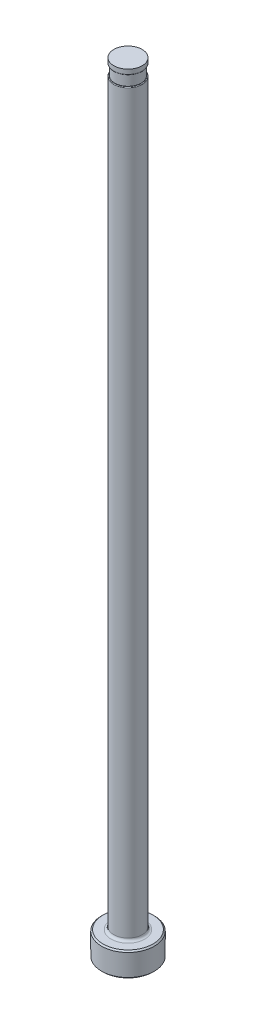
ISO-10303-21;
HEADER;
FILE_DESCRIPTION(('STEP AP214'),'2;1');
FILE_NAME('part.step','',(''),(''),'','','');
FILE_SCHEMA(('AUTOMOTIVE_DESIGN { 1 0 10303 214 1 1 1 1 }'));
ENDSEC;
DATA;
#1=APPLICATION_CONTEXT('core data for automotive mechanical design processes');
#2=APPLICATION_PROTOCOL_DEFINITION('international standard','automotive_design',2000,#1);
#3=PRODUCT_CONTEXT('',#1,'mechanical');
#4=PRODUCT('Part','Part','',(#3));
#5=PRODUCT_RELATED_PRODUCT_CATEGORY('part','',(#4));
#6=PRODUCT_DEFINITION_FORMATION('','',#4);
#7=PRODUCT_DEFINITION_CONTEXT('part definition',#1,'design');
#8=PRODUCT_DEFINITION('design','',#6,#7);
#9=PRODUCT_DEFINITION_SHAPE('','',#8);
#10=(LENGTH_UNIT() NAMED_UNIT(*) SI_UNIT(.MILLI.,.METRE.));
#11=(NAMED_UNIT(*) PLANE_ANGLE_UNIT() SI_UNIT($,.RADIAN.));
#12=(NAMED_UNIT(*) SI_UNIT($,.STERADIAN.) SOLID_ANGLE_UNIT());
#13=UNCERTAINTY_MEASURE_WITH_UNIT(LENGTH_MEASURE(1.E-05),#10,'distance_accuracy_value','');
#14=(GEOMETRIC_REPRESENTATION_CONTEXT(3) GLOBAL_UNCERTAINTY_ASSIGNED_CONTEXT((#13)) GLOBAL_UNIT_ASSIGNED_CONTEXT((#10,
#11,#12)) REPRESENTATION_CONTEXT('',''));
#15=CARTESIAN_POINT('',(0.,0.,0.));
#16=DIRECTION('',(0.,0.,1.));
#17=DIRECTION('',(1.,0.,0.));
#18=AXIS2_PLACEMENT_3D('',#15,#16,#17);
#19=CARTESIAN_POINT('',(-2.77748999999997,151.384,0.));
#20=DIRECTION('',(0.,1.,0.));
#21=DIRECTION('',(0.,0.,1.));
#22=AXIS2_PLACEMENT_3D('',#19,#20,#21);
#23=PLANE('',#22);
#24=CARTESIAN_POINT('',(0.,151.384,0.));
#25=DIRECTION('',(0.,1.,0.));
#26=DIRECTION('',(0.,0.,1.));
#27=AXIS2_PLACEMENT_3D('',#24,#25,#26);
#28=CIRCLE('',#27,2.64540999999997);
#29=CARTESIAN_POINT('',(0.,151.384,2.64540999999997));
#30=VERTEX_POINT('',#29);
#31=EDGE_CURVE('E11',#30,#30,#28,.F.);
#32=ORIENTED_EDGE('',*,*,#31,.T.);
#33=EDGE_LOOP('',(#32));
#34=FACE_BOUND('',#33,.T.);
#35=CARTESIAN_POINT('',(0.,151.384,0.));
#36=DIRECTION('',(0.,1.,0.));
#37=DIRECTION('',(0.,0.,1.));
#38=AXIS2_PLACEMENT_3D('',#35,#36,#37);
#39=CIRCLE('',#38,2.57428999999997);
#40=CARTESIAN_POINT('',(0.,151.384,2.57428999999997));
#41=VERTEX_POINT('',#40);
#42=EDGE_CURVE('E78',#41,#41,#39,.T.);
#43=ORIENTED_EDGE('',*,*,#42,.T.);
#44=EDGE_LOOP('',(#43));
#45=FACE_BOUND('',#44,.T.);
#46=ADVANCED_FACE('F36',(#34,#45),#23,.F.);
#47=CARTESIAN_POINT('',(0.,259.958771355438,0.));
#48=DIRECTION('',(0.,1.,0.));
#49=DIRECTION('',(0.,0.,1.));
#50=AXIS2_PLACEMENT_3D('',#47,#48,#49);
#51=CYLINDRICAL_SURFACE('',#50,2.77748999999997);
#52=DIRECTION('',(0.,1.,0.));
#53=VECTOR('',#52,1.);
#54=CARTESIAN_POINT('',(-2.57428999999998,259.958771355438,-1.04282390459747));
#55=LINE('',#54,#53);
#56=CARTESIAN_POINT('',(-2.57428999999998,149.225,-1.04282390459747));
#57=VERTEX_POINT('',#56);
#58=CARTESIAN_POINT('',(-2.57428999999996,86.868,-1.04282390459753));
#59=VERTEX_POINT('',#58);
#60=EDGE_CURVE('E73',#57,#59,#55,.F.);
#61=ORIENTED_EDGE('',*,*,#60,.F.);
#62=CARTESIAN_POINT('',(0.,149.225,0.));
#63=DIRECTION('',(0.,-1.,0.));
#64=DIRECTION('',(0.,0.,-1.));
#65=AXIS2_PLACEMENT_3D('',#62,#63,#64);
#66=CIRCLE('',#65,2.77748999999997);
#67=CARTESIAN_POINT('',(-2.57428999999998,149.225,1.04282390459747));
#68=VERTEX_POINT('',#67);
#69=EDGE_CURVE('E51',#57,#68,#66,.T.);
#70=ORIENTED_EDGE('',*,*,#69,.T.);
#71=DIRECTION('',(0.,1.,0.));
#72=VECTOR('',#71,1.);
#73=CARTESIAN_POINT('',(-2.57428999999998,259.958771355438,1.04282390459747));
#74=LINE('',#73,#72);
#75=CARTESIAN_POINT('',(-2.57428999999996,86.868,1.04282390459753));
#76=VERTEX_POINT('',#75);
#77=EDGE_CURVE('E84',#76,#68,#74,.T.);
#78=ORIENTED_EDGE('',*,*,#77,.F.);
#79=CARTESIAN_POINT('',(-2.57428999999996,86.868,-1.04282390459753));
#80=CARTESIAN_POINT('',(-2.57428787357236,86.8355852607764,-1.04282111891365));
#81=CARTESIAN_POINT('',(-2.57478701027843,86.8031850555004,-1.04159798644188));
#82=CARTESIAN_POINT('',(-2.57676382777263,86.7385964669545,-1.03670102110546));
#83=CARTESIAN_POINT('',(-2.57824163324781,86.7064081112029,-1.03302687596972));
#84=CARTESIAN_POINT('',(-2.58411032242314,86.610391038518,-1.01830472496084));
#85=CARTESIAN_POINT('',(-2.58993639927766,86.5471681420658,-1.00355696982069));
#86=CARTESIAN_POINT('',(-2.60484835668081,86.4241975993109,-0.964186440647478));
#87=CARTESIAN_POINT('',(-2.61393879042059,86.3644549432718,-0.939549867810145));
#88=CARTESIAN_POINT('',(-2.63439257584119,86.2504330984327,-0.880565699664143));
#89=CARTESIAN_POINT('',(-2.64575368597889,86.1961486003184,-0.846227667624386));
#90=CARTESIAN_POINT('',(-2.66906948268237,86.0963648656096,-0.769463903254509));
#91=CARTESIAN_POINT('',(-2.68099701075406,86.050654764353,-0.727304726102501));
#92=CARTESIAN_POINT('',(-2.70429977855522,85.9677106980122,-0.635186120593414));
#93=CARTESIAN_POINT('',(-2.71567511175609,85.930475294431,-0.585228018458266));
#94=CARTESIAN_POINT('',(-2.73569711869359,85.8680565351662,-0.482647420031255));
#95=CARTESIAN_POINT('',(-2.74447837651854,85.8422160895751,-0.430450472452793));
#96=CARTESIAN_POINT('',(-2.75929586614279,85.7997915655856,-0.322059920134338));
#97=CARTESIAN_POINT('',(-2.76533294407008,85.7832046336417,-0.265867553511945));
#98=CARTESIAN_POINT('',(-2.77376309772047,85.7602965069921,-0.153923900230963));
#99=CARTESIAN_POINT('',(-2.77631330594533,85.7535317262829,-0.0982747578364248));
#100=CARTESIAN_POINT('',(-2.77801884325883,85.7489917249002,0.0134385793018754));
#101=CARTESIAN_POINT('',(-2.7771745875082,85.751215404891,0.0695027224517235));
#102=CARTESIAN_POINT('',(-2.7722209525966,85.7644908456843,0.179520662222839));
#103=CARTESIAN_POINT('',(-2.76816343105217,85.7754024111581,0.233493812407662));
#104=CARTESIAN_POINT('',(-2.75726458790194,85.8056137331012,0.338736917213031));
#105=CARTESIAN_POINT('',(-2.7504233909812,85.8249131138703,0.390006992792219));
#106=CARTESIAN_POINT('',(-2.73459621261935,85.871579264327,0.488834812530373));
#107=CARTESIAN_POINT('',(-2.7255949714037,85.8990037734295,0.536362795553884));
#108=CARTESIAN_POINT('',(-2.70638807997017,85.9611227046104,0.626118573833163));
#109=CARTESIAN_POINT('',(-2.69618232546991,85.995817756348,0.668345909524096));
#110=CARTESIAN_POINT('',(-2.67522940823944,86.0727559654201,0.747895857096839));
#111=CARTESIAN_POINT('',(-2.66447542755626,86.1152077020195,0.785014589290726));
#112=CARTESIAN_POINT('',(-2.64380227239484,86.2056395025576,0.852053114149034));
#113=CARTESIAN_POINT('',(-2.63388340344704,86.2536215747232,0.881970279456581));
#114=CARTESIAN_POINT('',(-2.61524736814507,86.3568148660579,0.935839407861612));
#115=CARTESIAN_POINT('',(-2.60663744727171,86.4122867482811,0.959328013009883));
#116=CARTESIAN_POINT('',(-2.5921893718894,86.5264618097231,0.997711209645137));
#117=CARTESIAN_POINT('',(-2.58635078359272,86.5851644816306,1.01260714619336));
#118=CARTESIAN_POINT('',(-2.57955503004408,86.6815266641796,1.02975451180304));
#119=CARTESIAN_POINT('',(-2.57758531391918,86.7186676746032,1.03466198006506));
#120=CARTESIAN_POINT('',(-2.57495138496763,86.7932020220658,1.04119168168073));
#121=CARTESIAN_POINT('',(-2.57428434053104,86.8305946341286,1.04282104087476));
#122=CARTESIAN_POINT('',(-2.57428999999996,86.868,1.04282390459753));
#123=B_SPLINE_CURVE_WITH_KNOTS('',3,(#79,#80,#81,#82,#83,#84,#85,#86,#87,#88,#89,#90,#91,#92,
#93,#94,#95,#96,#97,#98,#99,#100,#101,#102,#103,#104,#105,#106,#107,#108,#109,#110,#111,#112,
#113,#114,#115,#116,#117,#118,#119,#120,#121,#122),.UNSPECIFIED.,.F.,.F.,(4,2,2,2,2,2,2,2,2,2,2,
2,2,2,2,2,2,2,2,2,2,4),(0.,0.0971880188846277,0.194388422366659,0.388960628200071,
0.583805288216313,0.778458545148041,0.967406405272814,1.15632216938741,1.33212671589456,
1.50787701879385,1.67541271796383,1.84292792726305,2.00779344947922,2.17265158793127,
2.33871056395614,2.5047839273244,2.67625192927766,2.84778239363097,3.02956415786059,
3.21131745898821,3.32371085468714,3.43585966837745),.UNSPECIFIED.);
#124=EDGE_CURVE('E81',#59,#76,#123,.T.);
#125=ORIENTED_EDGE('',*,*,#124,.F.);
#126=EDGE_LOOP('',(#61,#70,#78,#125));
#127=FACE_BOUND('',#126,.T.);
#128=CARTESIAN_POINT('',(0.,5.25779999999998,0.));
#129=DIRECTION('',(0.,1.,0.));
#130=DIRECTION('',(0.,0.,1.));
#131=AXIS2_PLACEMENT_3D('',#128,#129,#130);
#132=CIRCLE('',#131,2.77748999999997);
#133=CARTESIAN_POINT('',(0.,5.25779999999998,2.77748999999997));
#134=VERTEX_POINT('',#133);
#135=EDGE_CURVE('E116',#134,#134,#132,.T.);
#136=ORIENTED_EDGE('',*,*,#135,.T.);
#137=EDGE_LOOP('',(#136));
#138=FACE_BOUND('',#137,.T.);
#139=ADVANCED_FACE('F82',(#127,#138),#51,.T.);
#140=CARTESIAN_POINT('',(0.,0.,0.));
#141=DIRECTION('',(0.,-1.,0.));
#142=DIRECTION('',(0.,0.,-1.));
#143=AXIS2_PLACEMENT_3D('',#140,#141,#142);
#144=PLANE('',#143);
#145=CARTESIAN_POINT('',(0.,0.,0.));
#146=DIRECTION('',(0.,-1.,0.));
#147=DIRECTION('',(0.,0.,-1.));
#148=AXIS2_PLACEMENT_3D('',#145,#146,#147);
#149=CIRCLE('',#148,4.90220000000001);
#150=CARTESIAN_POINT('',(0.,0.,-4.90220000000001));
#151=VERTEX_POINT('',#150);
#152=EDGE_CURVE('E113',#151,#151,#149,.T.);
#153=ORIENTED_EDGE('',*,*,#152,.T.);
#154=EDGE_LOOP('',(#153));
#155=FACE_BOUND('',#154,.T.);
#156=ADVANCED_FACE('F192',(#155),#144,.T.);
#157=CARTESIAN_POINT('',(0.,259.958771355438,0.));
#158=DIRECTION('',(0.,1.,0.));
#159=DIRECTION('',(0.,0.,1.));
#160=AXIS2_PLACEMENT_3D('',#157,#158,#159);
#161=CYLINDRICAL_SURFACE('',#160,5.15619999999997);
#162=CARTESIAN_POINT('',(0.,4.49580000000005,0.));
#163=DIRECTION('',(0.,1.,0.));
#164=DIRECTION('',(0.,0.,1.));
#165=AXIS2_PLACEMENT_3D('',#162,#163,#164);
#166=CIRCLE('',#165,5.15619999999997);
#167=CARTESIAN_POINT('',(0.,4.49580000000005,5.15619999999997));
#168=VERTEX_POINT('',#167);
#169=EDGE_CURVE('E110',#168,#168,#166,.F.);
#170=ORIENTED_EDGE('',*,*,#169,.T.);
#171=EDGE_LOOP('',(#170));
#172=FACE_BOUND('',#171,.T.);
#173=CARTESIAN_POINT('',(0.,0.253999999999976,0.));
#174=DIRECTION('',(0.,-1.,0.));
#175=DIRECTION('',(0.,0.,-1.));
#176=AXIS2_PLACEMENT_3D('',#173,#174,#175);
#177=CIRCLE('',#176,5.15619999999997);
#178=CARTESIAN_POINT('',(0.,0.253999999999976,-5.15619999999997));
#179=VERTEX_POINT('',#178);
#180=EDGE_CURVE('E107',#179,#179,#177,.F.);
#181=ORIENTED_EDGE('',*,*,#180,.T.);
#182=EDGE_LOOP('',(#181));
#183=FACE_BOUND('',#182,.T.);
#184=ADVANCED_FACE('F195',(#172,#183),#161,.T.);
#185=CARTESIAN_POINT('',(-5.15619999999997,4.7498,0.));
#186=DIRECTION('',(0.,1.,0.));
#187=DIRECTION('',(0.,0.,1.));
#188=AXIS2_PLACEMENT_3D('',#185,#186,#187);
#189=PLANE('',#188);
#190=CARTESIAN_POINT('',(0.,4.7498,0.));
#191=DIRECTION('',(0.,1.,0.));
#192=DIRECTION('',(0.,0.,1.));
#193=AXIS2_PLACEMENT_3D('',#190,#191,#192);
#194=CIRCLE('',#193,3.28548999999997);
#195=CARTESIAN_POINT('',(0.,4.7498,3.28548999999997));
#196=VERTEX_POINT('',#195);
#197=EDGE_CURVE('E87',#196,#196,#194,.F.);
#198=ORIENTED_EDGE('',*,*,#197,.T.);
#199=EDGE_LOOP('',(#198));
#200=FACE_BOUND('',#199,.T.);
#201=CARTESIAN_POINT('',(0.,4.7498,0.));
#202=DIRECTION('',(0.,1.,0.));
#203=DIRECTION('',(0.,0.,1.));
#204=AXIS2_PLACEMENT_3D('',#201,#202,#203);
#205=CIRCLE('',#204,4.90220000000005);
#206=CARTESIAN_POINT('',(0.,4.7498,4.90220000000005));
#207=VERTEX_POINT('',#206);
#208=EDGE_CURVE('E104',#207,#207,#205,.T.);
#209=ORIENTED_EDGE('',*,*,#208,.T.);
#210=EDGE_LOOP('',(#209));
#211=FACE_BOUND('',#210,.T.);
#212=ADVANCED_FACE('F190',(#200,#211),#189,.T.);
#213=CARTESIAN_POINT('',(0.,4.74980000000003,0.));
#214=DIRECTION('',(0.,-1.,0.));
#215=DIRECTION('',(0.,0.,-1.));
#216=AXIS2_PLACEMENT_3D('',#213,#214,#215);
#217=CONICAL_SURFACE('',#216,4.90220000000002,0.785398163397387);
#218=ORIENTED_EDGE('',*,*,#169,.F.);
#219=EDGE_LOOP('',(#218));
#220=FACE_BOUND('',#219,.T.);
#221=ORIENTED_EDGE('',*,*,#208,.F.);
#222=EDGE_LOOP('',(#221));
#223=FACE_BOUND('',#222,.T.);
#224=ADVANCED_FACE('F186',(#220,#223),#217,.T.);
#225=CARTESIAN_POINT('',(0.,0.253999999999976,0.));
#226=DIRECTION('',(0.,1.,0.));
#227=DIRECTION('',(0.,0.,1.));
#228=AXIS2_PLACEMENT_3D('',#225,#226,#227);
#229=CONICAL_SURFACE('',#228,5.15619999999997,0.785398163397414);
#230=ORIENTED_EDGE('',*,*,#152,.F.);
#231=EDGE_LOOP('',(#230));
#232=FACE_BOUND('',#231,.T.);
#233=ORIENTED_EDGE('',*,*,#180,.F.);
#234=EDGE_LOOP('',(#233));
#235=FACE_BOUND('',#234,.T.);
#236=ADVANCED_FACE('F182',(#232,#235),#229,.T.);
#237=CARTESIAN_POINT('',(0.,5.25779999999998,0.));
#238=DIRECTION('',(0.,1.,0.));
#239=DIRECTION('',(0.,0.,1.));
#240=AXIS2_PLACEMENT_3D('',#237,#238,#239);
#241=TOROIDAL_SURFACE('',#240,3.28548999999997,0.508);
#242=ORIENTED_EDGE('',*,*,#197,.F.);
#243=EDGE_LOOP('',(#242));
#244=FACE_BOUND('',#243,.T.);
#245=ORIENTED_EDGE('',*,*,#135,.F.);
#246=EDGE_LOOP('',(#245));
#247=FACE_BOUND('',#246,.T.);
#248=ADVANCED_FACE('F147',(#244,#247),#241,.F.);
#249=CARTESIAN_POINT('',(-2.77748999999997,149.352,0.));
#250=DIRECTION('',(0.,-1.,0.));
#251=DIRECTION('',(0.,0.,-1.));
#252=AXIS2_PLACEMENT_3D('',#249,#250,#251);
#253=PLANE('',#252);
#254=DIRECTION('',(0.,0.,1.));
#255=VECTOR('',#254,1.);
#256=CARTESIAN_POINT('',(-2.57428999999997,149.352,0.));
#257=LINE('',#256,#255);
#258=CARTESIAN_POINT('',(-2.57428999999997,149.352,0.));
#259=VERTEX_POINT('',#258);
#260=CARTESIAN_POINT('',(-2.57428999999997,149.352,0.630974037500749));
#261=VERTEX_POINT('',#260);
#262=EDGE_CURVE('E90',#259,#261,#257,.T.);
#263=ORIENTED_EDGE('',*,*,#262,.T.);
#264=CARTESIAN_POINT('',(0.,149.352,0.));
#265=DIRECTION('',(0.,-1.,0.));
#266=DIRECTION('',(0.,0.,-1.));
#267=AXIS2_PLACEMENT_3D('',#264,#265,#266);
#268=CIRCLE('',#267,2.65048999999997);
#269=CARTESIAN_POINT('',(-2.57428999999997,149.352,-0.630974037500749));
#270=VERTEX_POINT('',#269);
#271=EDGE_CURVE('E86',#261,#270,#268,.F.);
#272=ORIENTED_EDGE('',*,*,#271,.T.);
#273=EDGE_CURVE('E79',#270,#259,#257,.T.);
#274=ORIENTED_EDGE('',*,*,#273,.T.);
#275=CARTESIAN_POINT('',(0.,149.352,0.));
#276=DIRECTION('',(0.,1.,0.));
#277=DIRECTION('',(0.,0.,1.));
#278=AXIS2_PLACEMENT_3D('',#275,#276,#277);
#279=CIRCLE('',#278,2.57428999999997);
#280=EDGE_CURVE('E101',#259,#259,#279,.T.);
#281=ORIENTED_EDGE('',*,*,#280,.F.);
#282=EDGE_LOOP('',(#263,#272,#274,#281));
#283=FACE_BOUND('',#282,.T.);
#284=ADVANCED_FACE('F144',(#283),#253,.F.);
#285=CARTESIAN_POINT('',(0.,153.448281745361,0.));
#286=DIRECTION('',(0.,1.,0.));
#287=DIRECTION('',(0.,0.,1.));
#288=AXIS2_PLACEMENT_3D('',#285,#286,#287);
#289=CYLINDRICAL_SURFACE('',#288,2.57428999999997);
#290=ORIENTED_EDGE('',*,*,#42,.F.);
#291=EDGE_LOOP('',(#290));
#292=FACE_BOUND('',#291,.T.);
#293=ORIENTED_EDGE('',*,*,#280,.T.);
#294=EDGE_LOOP('',(#293));
#295=FACE_BOUND('',#294,.T.);
#296=ADVANCED_FACE('F141',(#292,#295),#289,.T.);
#297=CARTESIAN_POINT('',(-2.57428999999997,150.368,-5.15619999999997));
#298=DIRECTION('',(1.,0.,0.));
#299=DIRECTION('',(0.,1.,0.));
#300=AXIS2_PLACEMENT_3D('',#297,#298,#299);
#301=PLANE('',#300);
#302=ORIENTED_EDGE('',*,*,#273,.F.);
#303=CARTESIAN_POINT('',(-2.57428999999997,149.352,-0.630974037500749));
#304=CARTESIAN_POINT('',(-2.57428999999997,149.351988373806,-0.652186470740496));
#305=CARTESIAN_POINT('',(-2.57428999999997,149.351697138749,-0.67340907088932));
#306=CARTESIAN_POINT('',(-2.57428999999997,149.350309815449,-0.715909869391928));
#307=CARTESIAN_POINT('',(-2.57428999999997,149.349210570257,-0.737187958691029));
#308=CARTESIAN_POINT('',(-2.57428999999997,149.345955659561,-0.779696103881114));
#309=CARTESIAN_POINT('',(-2.57428999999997,149.343798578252,-0.800926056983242));
#310=CARTESIAN_POINT('',(-2.57428999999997,149.338053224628,-0.843171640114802));
#311=CARTESIAN_POINT('',(-2.57428999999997,149.334467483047,-0.864187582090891));
#312=CARTESIAN_POINT('',(-2.57428999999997,149.32767465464,-0.894737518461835));
#313=CARTESIAN_POINT('',(-2.57428999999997,149.325275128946,-0.904450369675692));
#314=CARTESIAN_POINT('',(-2.57428999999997,149.319899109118,-0.923745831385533));
#315=CARTESIAN_POINT('',(-2.57428999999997,149.316921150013,-0.93332804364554));
#316=CARTESIAN_POINT('',(-2.57428999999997,149.309733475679,-0.95367532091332));
#317=CARTESIAN_POINT('',(-2.57428999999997,149.305405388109,-0.964399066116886));
#318=CARTESIAN_POINT('',(-2.57428999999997,149.295429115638,-0.985202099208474));
#319=CARTESIAN_POINT('',(-2.57428999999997,149.289787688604,-0.995284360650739));
#320=CARTESIAN_POINT('',(-2.57428999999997,149.280621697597,-1.00826014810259));
#321=CARTESIAN_POINT('',(-2.57428999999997,149.277943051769,-1.01174615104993));
#322=CARTESIAN_POINT('',(-2.57428999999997,149.272228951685,-1.01843326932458));
#323=CARTESIAN_POINT('',(-2.57428999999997,149.269192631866,-1.02163365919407));
#324=CARTESIAN_POINT('',(-2.57428999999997,149.262665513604,-1.02764631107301));
#325=CARTESIAN_POINT('',(-2.57428999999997,149.259168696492,-1.03045218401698));
#326=CARTESIAN_POINT('',(-2.57428999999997,149.251739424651,-1.03537629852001));
#327=CARTESIAN_POINT('',(-2.57428999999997,149.247810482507,-1.03749960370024));
#328=CARTESIAN_POINT('',(-2.57428999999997,149.240740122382,-1.04030637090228));
#329=CARTESIAN_POINT('',(-2.57428999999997,149.23769508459,-1.04122798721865));
#330=CARTESIAN_POINT('',(-2.57428999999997,149.231439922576,-1.04249667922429));
#331=CARTESIAN_POINT('',(-2.57428999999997,149.228227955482,-1.04283449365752));
#332=CARTESIAN_POINT('',(-2.57428999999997,149.225,-1.04282390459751));
#333=B_SPLINE_CURVE_WITH_KNOTS('',3,(#303,#304,#305,#306,#307,#308,#309,#310,#311,#312,#313,
#314,#315,#316,#317,#318,#319,#320,#321,#322,#323,#324,#325,#326,#327,#328,#329,#330,#331,#332),
.UNSPECIFIED.,.F.,.F.,(4,2,2,2,2,2,2,2,2,2,2,2,2,2,4),(0.,0.0636515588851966,0.127553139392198,
0.191540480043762,0.255414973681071,0.285417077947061,0.315496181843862,0.350142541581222,
0.384614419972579,0.397785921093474,0.410989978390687,0.424387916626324,0.437684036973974,
0.447175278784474,0.45681575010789),.UNSPECIFIED.);
#334=EDGE_CURVE('E59',#270,#57,#333,.T.);
#335=ORIENTED_EDGE('',*,*,#334,.T.);
#336=ORIENTED_EDGE('',*,*,#60,.T.);
#337=DIRECTION('',(0.,0.,1.));
#338=VECTOR('',#337,1.);
#339=CARTESIAN_POINT('',(-2.57428999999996,86.868,-5.15619999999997));
#340=LINE('',#339,#338);
#341=EDGE_CURVE('E77',#59,#76,#340,.T.);
#342=ORIENTED_EDGE('',*,*,#341,.T.);
#343=ORIENTED_EDGE('',*,*,#77,.T.);
#344=CARTESIAN_POINT('',(-2.57428999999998,149.225,1.04282390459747));
#345=CARTESIAN_POINT('',(-2.57428999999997,149.227997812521,1.04283236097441));
#346=CARTESIAN_POINT('',(-2.57428999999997,149.230984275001,1.04254163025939));
#347=CARTESIAN_POINT('',(-2.57428999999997,149.23682304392,1.04144104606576));
#348=CARTESIAN_POINT('',(-2.57428999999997,149.239676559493,1.04063771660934));
#349=CARTESIAN_POINT('',(-2.57428999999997,149.245880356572,1.03834208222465));
#350=CARTESIAN_POINT('',(-2.57428999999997,149.249185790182,1.03673079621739));
#351=CARTESIAN_POINT('',(-2.57428999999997,149.255505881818,1.03299596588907));
#352=CARTESIAN_POINT('',(-2.57428999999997,149.258518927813,1.03086978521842));
#353=CARTESIAN_POINT('',(-2.57428999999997,149.266062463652,1.02479237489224));
#354=CARTESIAN_POINT('',(-2.57428999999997,149.270345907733,1.02053793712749));
#355=CARTESIAN_POINT('',(-2.57428999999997,149.278251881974,1.01146538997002));
#356=CARTESIAN_POINT('',(-2.57428999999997,149.281873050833,1.00664615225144));
#357=CARTESIAN_POINT('',(-2.57428999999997,149.292266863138,0.991217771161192));
#358=CARTESIAN_POINT('',(-2.57428999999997,149.298166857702,0.980028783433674));
#359=CARTESIAN_POINT('',(-2.57428999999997,149.308501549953,0.957006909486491));
#360=CARTESIAN_POINT('',(-2.57428999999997,149.312931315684,0.945172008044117));
#361=CARTESIAN_POINT('',(-2.57428999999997,149.323366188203,0.913140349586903));
#362=CARTESIAN_POINT('',(-2.57428999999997,149.328443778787,0.892644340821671));
#363=CARTESIAN_POINT('',(-2.57428999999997,149.336753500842,0.851271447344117));
#364=CARTESIAN_POINT('',(-2.57428999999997,149.339981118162,0.830393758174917));
#365=CARTESIAN_POINT('',(-2.57428999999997,149.347717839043,0.767434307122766));
#366=CARTESIAN_POINT('',(-2.57428999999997,149.350259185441,0.725112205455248));
#367=CARTESIAN_POINT('',(-2.57428999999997,149.351575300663,0.674152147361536));
#368=CARTESIAN_POINT('',(-2.57428999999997,149.351738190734,0.665497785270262));
#369=CARTESIAN_POINT('',(-2.57428999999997,149.351950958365,0.648220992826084));
#370=CARTESIAN_POINT('',(-2.57428999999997,149.35200126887,0.639598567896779));
#371=CARTESIAN_POINT('',(-2.57428999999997,149.352,0.63097403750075));
#372=B_SPLINE_CURVE_WITH_KNOTS('',3,(#344,#345,#346,#347,#348,#349,#350,#351,#352,#353,#354,
#355,#356,#357,#358,#359,#360,#361,#362,#363,#364,#365,#366,#367,#368,#369,#370,#371),
.UNSPECIFIED.,.F.,.F.,(4,2,2,2,2,2,2,2,2,2,2,2,2,4),(0.,0.00896107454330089,0.0178103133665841,
0.0287804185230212,0.0398079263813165,0.0578172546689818,0.0758631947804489,0.113599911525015,
0.151461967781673,0.214643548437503,0.277978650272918,0.404912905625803,0.430882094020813,
0.45675124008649),.UNSPECIFIED.);
#373=EDGE_CURVE('E172',#68,#261,#372,.T.);
#374=ORIENTED_EDGE('',*,*,#373,.T.);
#375=ORIENTED_EDGE('',*,*,#262,.F.);
#376=EDGE_LOOP('',(#302,#335,#336,#342,#343,#374,#375));
#377=FACE_BOUND('',#376,.T.);
#378=ADVANCED_FACE('F75',(#377),#301,.F.);
#379=CARTESIAN_POINT('',(-5.74928999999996,86.868,-5.15619999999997));
#380=DIRECTION('',(0.,0.,1.));
#381=DIRECTION('',(1.,0.,0.));
#382=AXIS2_PLACEMENT_3D('',#379,#380,#381);
#383=CYLINDRICAL_SURFACE('',#382,3.175);
#384=ORIENTED_EDGE('',*,*,#341,.F.);
#385=ORIENTED_EDGE('',*,*,#124,.T.);
#386=EDGE_LOOP('',(#384,#385));
#387=FACE_BOUND('',#386,.T.);
#388=ADVANCED_FACE('F89',(#387),#383,.F.);
#389=CARTESIAN_POINT('',(0.,152.687735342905,0.));
#390=DIRECTION('',(0.,1.,0.));
#391=DIRECTION('',(0.,0.,1.));
#392=AXIS2_PLACEMENT_3D('',#389,#390,#391);
#393=CYLINDRICAL_SURFACE('',#392,2.77240999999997);
#394=CARTESIAN_POINT('',(0.,151.511,0.));
#395=DIRECTION('',(0.,1.,0.));
#396=DIRECTION('',(0.,0.,1.));
#397=AXIS2_PLACEMENT_3D('',#394,#395,#396);
#398=CIRCLE('',#397,2.77240999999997);
#399=CARTESIAN_POINT('',(0.,151.511,2.77240999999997));
#400=VERTEX_POINT('',#399);
#401=EDGE_CURVE('E44',#400,#400,#398,.T.);
#402=ORIENTED_EDGE('',*,*,#401,.T.);
#403=EDGE_LOOP('',(#402));
#404=FACE_BOUND('',#403,.T.);
#405=CARTESIAN_POINT('',(0.,152.4,0.));
#406=DIRECTION('',(0.,1.,0.));
#407=DIRECTION('',(0.,0.,1.));
#408=AXIS2_PLACEMENT_3D('',#405,#406,#407);
#409=CIRCLE('',#408,2.77240999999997);
#410=CARTESIAN_POINT('',(0.,152.4,2.77240999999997));
#411=VERTEX_POINT('',#410);
#412=EDGE_CURVE('E91',#411,#411,#409,.T.);
#413=ORIENTED_EDGE('',*,*,#412,.F.);
#414=EDGE_LOOP('',(#413));
#415=FACE_BOUND('',#414,.T.);
#416=ADVANCED_FACE('F135',(#404,#415),#393,.T.);
#417=CARTESIAN_POINT('',(-2.77748999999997,152.4,0.));
#418=DIRECTION('',(0.,1.,0.));
#419=DIRECTION('',(0.,0.,1.));
#420=AXIS2_PLACEMENT_3D('',#417,#418,#419);
#421=PLANE('',#420);
#422=ORIENTED_EDGE('',*,*,#412,.T.);
#423=EDGE_LOOP('',(#422));
#424=FACE_BOUND('',#423,.T.);
#425=ADVANCED_FACE('F149',(#424),#421,.T.);
#426=CARTESIAN_POINT('',(0.,149.225,0.));
#427=DIRECTION('',(0.,-1.,0.));
#428=DIRECTION('',(0.,0.,-1.));
#429=AXIS2_PLACEMENT_3D('',#426,#427,#428);
#430=TOROIDAL_SURFACE('',#429,2.65048999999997,0.127);
#431=ORIENTED_EDGE('',*,*,#373,.F.);
#432=ORIENTED_EDGE('',*,*,#69,.F.);
#433=ORIENTED_EDGE('',*,*,#334,.F.);
#434=ORIENTED_EDGE('',*,*,#271,.F.);
#435=EDGE_LOOP('',(#431,#432,#433,#434));
#436=FACE_BOUND('',#435,.T.);
#437=ADVANCED_FACE('F151',(#436),#430,.T.);
#438=CARTESIAN_POINT('',(0.,151.511,0.));
#439=DIRECTION('',(0.,1.,0.));
#440=DIRECTION('',(0.,0.,1.));
#441=AXIS2_PLACEMENT_3D('',#438,#439,#440);
#442=TOROIDAL_SURFACE('',#441,2.64540999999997,0.127);
#443=ORIENTED_EDGE('',*,*,#31,.F.);
#444=EDGE_LOOP('',(#443));
#445=FACE_BOUND('',#444,.T.);
#446=ORIENTED_EDGE('',*,*,#401,.F.);
#447=EDGE_LOOP('',(#446));
#448=FACE_BOUND('',#447,.T.);
#449=ADVANCED_FACE('F38',(#445,#448),#442,.T.);
#450=CLOSED_SHELL('',(#46,#139,#156,#184,#212,#224,#236,#248,#284,#296,#378,#388,#416,#425,#437,#449));
#451=MANIFOLD_SOLID_BREP('B2',#450);
#452=ADVANCED_BREP_SHAPE_REPRESENTATION('',(#18,#451),#14);
#453=SHAPE_DEFINITION_REPRESENTATION(#9,#452);
ENDSEC;
END-ISO-10303-21;
